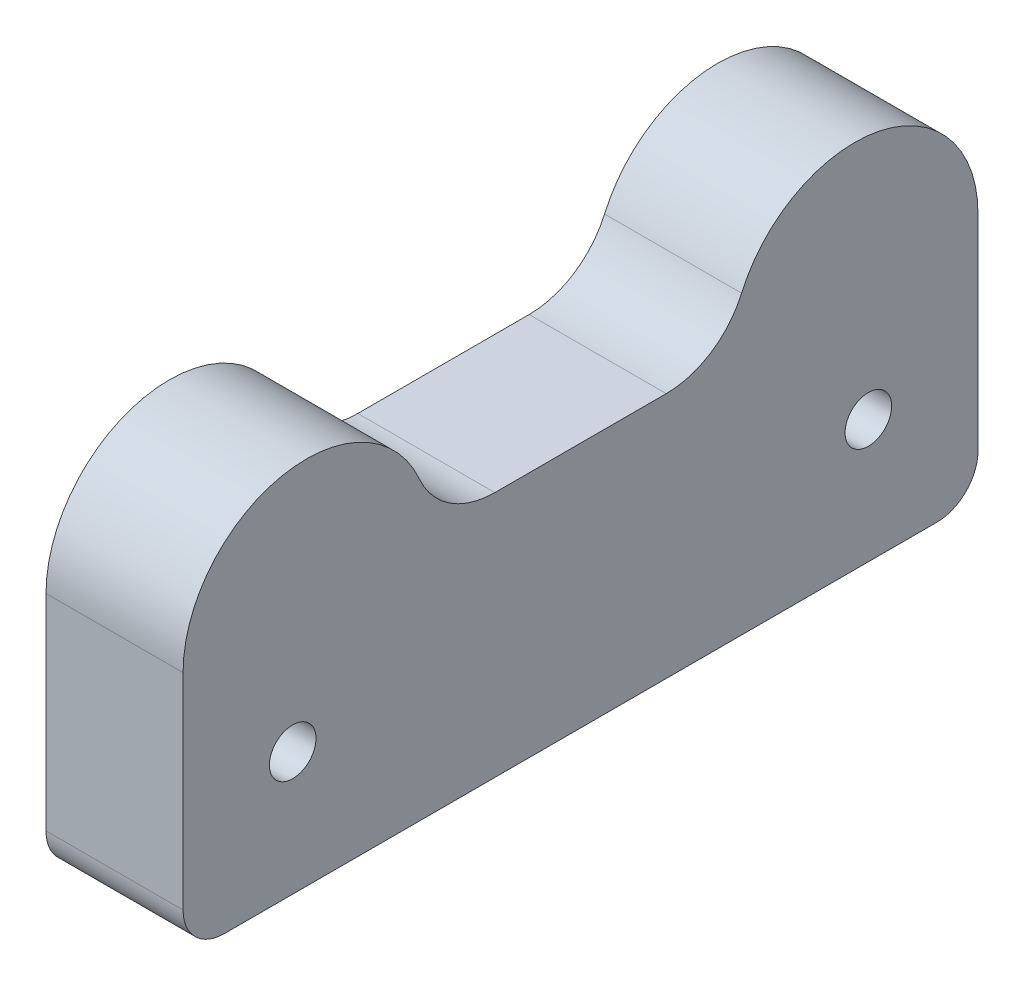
ISO-10303-21;
HEADER;
FILE_DESCRIPTION(('STEP AP214'),'2;1');
FILE_NAME('part.step','',(''),(''),'','','');
FILE_SCHEMA(('AUTOMOTIVE_DESIGN { 1 0 10303 214 1 1 1 1 }'));
ENDSEC;
DATA;
#1=APPLICATION_CONTEXT('core data for automotive mechanical design processes');
#2=APPLICATION_PROTOCOL_DEFINITION('international standard','automotive_design',2000,#1);
#3=PRODUCT_CONTEXT('',#1,'mechanical');
#4=PRODUCT('Part','Part','',(#3));
#5=PRODUCT_RELATED_PRODUCT_CATEGORY('part','',(#4));
#6=PRODUCT_DEFINITION_FORMATION('','',#4);
#7=PRODUCT_DEFINITION_CONTEXT('part definition',#1,'design');
#8=PRODUCT_DEFINITION('design','',#6,#7);
#9=PRODUCT_DEFINITION_SHAPE('','',#8);
#10=(LENGTH_UNIT() NAMED_UNIT(*) SI_UNIT(.MILLI.,.METRE.));
#11=(NAMED_UNIT(*) PLANE_ANGLE_UNIT() SI_UNIT($,.RADIAN.));
#12=(NAMED_UNIT(*) SI_UNIT($,.STERADIAN.) SOLID_ANGLE_UNIT());
#13=UNCERTAINTY_MEASURE_WITH_UNIT(LENGTH_MEASURE(1.E-05),#10,'distance_accuracy_value','');
#14=(GEOMETRIC_REPRESENTATION_CONTEXT(3) GLOBAL_UNCERTAINTY_ASSIGNED_CONTEXT((#13)) GLOBAL_UNIT_ASSIGNED_CONTEXT((#10,
#11,#12)) REPRESENTATION_CONTEXT('',''));
#15=CARTESIAN_POINT('',(0.,0.,0.));
#16=DIRECTION('',(0.,0.,1.));
#17=DIRECTION('',(1.,0.,0.));
#18=AXIS2_PLACEMENT_3D('',#15,#16,#17);
#19=CARTESIAN_POINT('',(10.,0.,0.));
#20=DIRECTION('',(0.,0.,-1.));
#21=DIRECTION('',(-1.,0.,0.));
#22=AXIS2_PLACEMENT_3D('',#19,#20,#21);
#23=PLANE('',#22);
#24=DIRECTION('',(0.,-1.,0.));
#25=VECTOR('',#24,1.);
#26=CARTESIAN_POINT('',(0.,0.,0.));
#27=LINE('',#26,#25);
#28=CARTESIAN_POINT('',(0.,18.,0.));
#29=VERTEX_POINT('',#28);
#30=CARTESIAN_POINT('',(0.,3.,0.));
#31=VERTEX_POINT('',#30);
#32=EDGE_CURVE('E161',#29,#31,#27,.T.);
#33=ORIENTED_EDGE('',*,*,#32,.T.);
#34=DIRECTION('',(-1.,0.,0.));
#35=VECTOR('',#34,1.);
#36=CARTESIAN_POINT('',(10.,3.,0.));
#37=LINE('',#36,#35);
#38=CARTESIAN_POINT('',(10.,3.,0.));
#39=VERTEX_POINT('',#38);
#40=EDGE_CURVE('E183',#31,#39,#37,.F.);
#41=ORIENTED_EDGE('',*,*,#40,.T.);
#42=DIRECTION('',(0.,-1.,0.));
#43=VECTOR('',#42,1.);
#44=CARTESIAN_POINT('',(10.,0.,0.));
#45=LINE('',#44,#43);
#46=CARTESIAN_POINT('',(10.,18.,0.));
#47=VERTEX_POINT('',#46);
#48=EDGE_CURVE('E151',#47,#39,#45,.T.);
#49=ORIENTED_EDGE('',*,*,#48,.F.);
#50=DIRECTION('',(-1.,0.,0.));
#51=VECTOR('',#50,1.);
#52=CARTESIAN_POINT('',(10.,18.,0.));
#53=LINE('',#52,#51);
#54=EDGE_CURVE('E140',#47,#29,#53,.T.);
#55=ORIENTED_EDGE('',*,*,#54,.T.);
#56=EDGE_LOOP('',(#33,#41,#49,#55));
#57=FACE_BOUND('',#56,.T.);
#58=ADVANCED_FACE('F41',(#57),#23,.F.);
#59=CARTESIAN_POINT('',(10.,0.,0.));
#60=DIRECTION('',(0.,1.,0.));
#61=DIRECTION('',(0.,0.,1.));
#62=AXIS2_PLACEMENT_3D('',#59,#60,#61);
#63=PLANE('',#62);
#64=DIRECTION('',(0.,0.,-1.));
#65=VECTOR('',#64,1.);
#66=CARTESIAN_POINT('',(0.,0.,0.));
#67=LINE('',#66,#65);
#68=CARTESIAN_POINT('',(0.,0.,-3.));
#69=VERTEX_POINT('',#68);
#70=CARTESIAN_POINT('',(0.,0.,-55.));
#71=VERTEX_POINT('',#70);
#72=EDGE_CURVE('E130',#69,#71,#67,.T.);
#73=ORIENTED_EDGE('',*,*,#72,.T.);
#74=DIRECTION('',(-1.,0.,0.));
#75=VECTOR('',#74,1.);
#76=CARTESIAN_POINT('',(10.,0.,-55.));
#77=LINE('',#76,#75);
#78=CARTESIAN_POINT('',(10.,0.,-55.));
#79=VERTEX_POINT('',#78);
#80=EDGE_CURVE('E179',#71,#79,#77,.F.);
#81=ORIENTED_EDGE('',*,*,#80,.T.);
#82=DIRECTION('',(0.,0.,-1.));
#83=VECTOR('',#82,1.);
#84=CARTESIAN_POINT('',(10.,0.,0.));
#85=LINE('',#84,#83);
#86=CARTESIAN_POINT('',(10.,0.,-3.));
#87=VERTEX_POINT('',#86);
#88=EDGE_CURVE('E152',#87,#79,#85,.T.);
#89=ORIENTED_EDGE('',*,*,#88,.F.);
#90=DIRECTION('',(-1.,0.,0.));
#91=VECTOR('',#90,1.);
#92=CARTESIAN_POINT('',(10.,0.,-3.));
#93=LINE('',#92,#91);
#94=EDGE_CURVE('E177',#87,#69,#93,.T.);
#95=ORIENTED_EDGE('',*,*,#94,.T.);
#96=EDGE_LOOP('',(#73,#81,#89,#95));
#97=FACE_BOUND('',#96,.T.);
#98=ADVANCED_FACE('F218',(#97),#63,.F.);
#99=CARTESIAN_POINT('',(10.,0.,-58.));
#100=DIRECTION('',(0.,0.,1.));
#101=DIRECTION('',(1.,0.,0.));
#102=AXIS2_PLACEMENT_3D('',#99,#100,#101);
#103=PLANE('',#102);
#104=DIRECTION('',(0.,1.,0.));
#105=VECTOR('',#104,1.);
#106=CARTESIAN_POINT('',(10.,0.,-58.));
#107=LINE('',#106,#105);
#108=CARTESIAN_POINT('',(10.,3.,-58.));
#109=VERTEX_POINT('',#108);
#110=CARTESIAN_POINT('',(10.,18.,-58.));
#111=VERTEX_POINT('',#110);
#112=EDGE_CURVE('E160',#109,#111,#107,.T.);
#113=ORIENTED_EDGE('',*,*,#112,.F.);
#114=DIRECTION('',(-1.,0.,0.));
#115=VECTOR('',#114,1.);
#116=CARTESIAN_POINT('',(10.,3.,-58.));
#117=LINE('',#116,#115);
#118=CARTESIAN_POINT('',(0.,3.,-58.));
#119=VERTEX_POINT('',#118);
#120=EDGE_CURVE('E123',#109,#119,#117,.T.);
#121=ORIENTED_EDGE('',*,*,#120,.T.);
#122=DIRECTION('',(0.,1.,0.));
#123=VECTOR('',#122,1.);
#124=CARTESIAN_POINT('',(0.,0.,-58.));
#125=LINE('',#124,#123);
#126=CARTESIAN_POINT('',(0.,18.,-58.));
#127=VERTEX_POINT('',#126);
#128=EDGE_CURVE('E119',#119,#127,#125,.T.);
#129=ORIENTED_EDGE('',*,*,#128,.T.);
#130=DIRECTION('',(-1.,0.,0.));
#131=VECTOR('',#130,1.);
#132=CARTESIAN_POINT('',(10.,18.,-58.));
#133=LINE('',#132,#131);
#134=EDGE_CURVE('E122',#111,#127,#133,.T.);
#135=ORIENTED_EDGE('',*,*,#134,.F.);
#136=EDGE_LOOP('',(#113,#121,#129,#135));
#137=FACE_BOUND('',#136,.T.);
#138=ADVANCED_FACE('F116',(#137),#103,.F.);
#139=CARTESIAN_POINT('',(10.,18.,0.));
#140=DIRECTION('',(0.,-1.,0.));
#141=DIRECTION('',(0.,0.,-1.));
#142=AXIS2_PLACEMENT_3D('',#139,#140,#141);
#143=PLANE('',#142);
#144=DIRECTION('',(0.,0.,1.));
#145=VECTOR('',#144,1.);
#146=CARTESIAN_POINT('',(10.,18.,0.));
#147=LINE('',#146,#145);
#148=CARTESIAN_POINT('',(10.,18.,-35.2522729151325));
#149=VERTEX_POINT('',#148);
#150=CARTESIAN_POINT('',(10.,18.,-22.7477270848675));
#151=VERTEX_POINT('',#150);
#152=EDGE_CURVE('E157',#149,#151,#147,.T.);
#153=ORIENTED_EDGE('',*,*,#152,.F.);
#154=DIRECTION('',(1.,0.,0.));
#155=VECTOR('',#154,1.);
#156=CARTESIAN_POINT('',(10.,18.,-35.2522729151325));
#157=LINE('',#156,#155);
#158=CARTESIAN_POINT('',(0.,18.,-35.2522729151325));
#159=VERTEX_POINT('',#158);
#160=EDGE_CURVE('E186',#149,#159,#157,.F.);
#161=ORIENTED_EDGE('',*,*,#160,.T.);
#162=DIRECTION('',(0.,0.,1.));
#163=VECTOR('',#162,1.);
#164=CARTESIAN_POINT('',(0.,18.,0.));
#165=LINE('',#164,#163);
#166=CARTESIAN_POINT('',(0.,18.,-22.7477270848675));
#167=VERTEX_POINT('',#166);
#168=EDGE_CURVE('E127',#159,#167,#165,.T.);
#169=ORIENTED_EDGE('',*,*,#168,.T.);
#170=DIRECTION('',(1.,0.,0.));
#171=VECTOR('',#170,1.);
#172=CARTESIAN_POINT('',(10.,18.,-22.7477270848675));
#173=LINE('',#172,#171);
#174=EDGE_CURVE('E189',#167,#151,#173,.T.);
#175=ORIENTED_EDGE('',*,*,#174,.T.);
#176=EDGE_LOOP('',(#153,#161,#169,#175));
#177=FACE_BOUND('',#176,.T.);
#178=ADVANCED_FACE('F204',(#177),#143,.F.);
#179=CARTESIAN_POINT('',(10.,0.,0.));
#180=DIRECTION('',(-1.,0.,0.));
#181=DIRECTION('',(0.,0.,1.));
#182=AXIS2_PLACEMENT_3D('',#179,#180,#181);
#183=PLANE('',#182);
#184=CARTESIAN_POINT('',(10.,9.,-8.));
#185=DIRECTION('',(1.,0.,0.));
#186=DIRECTION('',(0.,0.,-1.));
#187=AXIS2_PLACEMENT_3D('',#184,#185,#186);
#188=CIRCLE('',#187,1.7);
#189=CARTESIAN_POINT('',(10.,9.,-9.7));
#190=VERTEX_POINT('',#189);
#191=EDGE_CURVE('E150',#190,#190,#188,.T.);
#192=ORIENTED_EDGE('',*,*,#191,.F.);
#193=EDGE_LOOP('',(#192));
#194=FACE_BOUND('',#193,.T.);
#195=CARTESIAN_POINT('',(10.,9.,-50.));
#196=DIRECTION('',(1.,0.,0.));
#197=DIRECTION('',(0.,0.,-1.));
#198=AXIS2_PLACEMENT_3D('',#195,#196,#197);
#199=CIRCLE('',#198,1.7);
#200=CARTESIAN_POINT('',(10.,9.,-51.7));
#201=VERTEX_POINT('',#200);
#202=EDGE_CURVE('E258',#201,#201,#199,.T.);
#203=ORIENTED_EDGE('',*,*,#202,.F.);
#204=EDGE_LOOP('',(#203));
#205=FACE_BOUND('',#204,.T.);
#206=ORIENTED_EDGE('',*,*,#88,.T.);
#207=CARTESIAN_POINT('',(10.,3.,-55.));
#208=DIRECTION('',(-1.,0.,0.));
#209=DIRECTION('',(0.,0.,1.));
#210=AXIS2_PLACEMENT_3D('',#207,#208,#209);
#211=CIRCLE('',#210,3.);
#212=EDGE_CURVE('E181',#79,#109,#211,.F.);
#213=ORIENTED_EDGE('',*,*,#212,.T.);
#214=ORIENTED_EDGE('',*,*,#112,.T.);
#215=CARTESIAN_POINT('',(10.,18.,-49.));
#216=DIRECTION('',(1.,0.,0.));
#217=DIRECTION('',(0.,0.,-1.));
#218=AXIS2_PLACEMENT_3D('',#215,#216,#217);
#219=CIRCLE('',#218,9.);
#220=CARTESIAN_POINT('',(10.,21.6,-40.7513637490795));
#221=VERTEX_POINT('',#220);
#222=EDGE_CURVE('E137',#111,#221,#219,.T.);
#223=ORIENTED_EDGE('',*,*,#222,.T.);
#224=CARTESIAN_POINT('',(10.,24.,-35.2522729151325));
#225=DIRECTION('',(-1.,0.,0.));
#226=DIRECTION('',(0.,0.,1.));
#227=AXIS2_PLACEMENT_3D('',#224,#225,#226);
#228=CIRCLE('',#227,6.);
#229=EDGE_CURVE('E197',#221,#149,#228,.T.);
#230=ORIENTED_EDGE('',*,*,#229,.T.);
#231=ORIENTED_EDGE('',*,*,#152,.T.);
#232=CARTESIAN_POINT('',(10.,24.,-22.7477270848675));
#233=DIRECTION('',(-1.,0.,0.));
#234=DIRECTION('',(0.,0.,1.));
#235=AXIS2_PLACEMENT_3D('',#232,#233,#234);
#236=CIRCLE('',#235,6.);
#237=CARTESIAN_POINT('',(10.,21.6,-17.2486362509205));
#238=VERTEX_POINT('',#237);
#239=EDGE_CURVE('E47',#151,#238,#236,.T.);
#240=ORIENTED_EDGE('',*,*,#239,.T.);
#241=CARTESIAN_POINT('',(10.,18.,-9.));
#242=DIRECTION('',(1.,0.,0.));
#243=DIRECTION('',(0.,0.,-1.));
#244=AXIS2_PLACEMENT_3D('',#241,#242,#243);
#245=CIRCLE('',#244,9.);
#246=EDGE_CURVE('E145',#238,#47,#245,.T.);
#247=ORIENTED_EDGE('',*,*,#246,.T.);
#248=ORIENTED_EDGE('',*,*,#48,.T.);
#249=CARTESIAN_POINT('',(10.,3.,-3.));
#250=DIRECTION('',(-1.,0.,0.));
#251=DIRECTION('',(0.,0.,1.));
#252=AXIS2_PLACEMENT_3D('',#249,#250,#251);
#253=CIRCLE('',#252,3.);
#254=EDGE_CURVE('E182',#39,#87,#253,.F.);
#255=ORIENTED_EDGE('',*,*,#254,.T.);
#256=EDGE_LOOP('',(#206,#213,#214,#223,#230,#231,#240,#247,#248,#255));
#257=FACE_BOUND('',#256,.T.);
#258=ADVANCED_FACE('F199',(#194,#205,#257),#183,.F.);
#259=CARTESIAN_POINT('',(0.,0.,0.));
#260=DIRECTION('',(-1.,0.,0.));
#261=DIRECTION('',(0.,0.,1.));
#262=AXIS2_PLACEMENT_3D('',#259,#260,#261);
#263=PLANE('',#262);
#264=CARTESIAN_POINT('',(0.,9.,-8.));
#265=DIRECTION('',(1.,0.,0.));
#266=DIRECTION('',(0.,0.,-1.));
#267=AXIS2_PLACEMENT_3D('',#264,#265,#266);
#268=CIRCLE('',#267,1.7);
#269=CARTESIAN_POINT('',(0.,9.,-9.7));
#270=VERTEX_POINT('',#269);
#271=EDGE_CURVE('E142',#270,#270,#268,.T.);
#272=ORIENTED_EDGE('',*,*,#271,.T.);
#273=EDGE_LOOP('',(#272));
#274=FACE_BOUND('',#273,.T.);
#275=CARTESIAN_POINT('',(0.,9.,-50.));
#276=DIRECTION('',(1.,0.,0.));
#277=DIRECTION('',(0.,0.,-1.));
#278=AXIS2_PLACEMENT_3D('',#275,#276,#277);
#279=CIRCLE('',#278,1.7);
#280=CARTESIAN_POINT('',(0.,9.,-51.7));
#281=VERTEX_POINT('',#280);
#282=EDGE_CURVE('E251',#281,#281,#279,.T.);
#283=ORIENTED_EDGE('',*,*,#282,.T.);
#284=EDGE_LOOP('',(#283));
#285=FACE_BOUND('',#284,.T.);
#286=ORIENTED_EDGE('',*,*,#128,.F.);
#287=CARTESIAN_POINT('',(0.,3.,-55.));
#288=DIRECTION('',(-1.,0.,0.));
#289=DIRECTION('',(0.,0.,1.));
#290=AXIS2_PLACEMENT_3D('',#287,#288,#289);
#291=CIRCLE('',#290,3.);
#292=EDGE_CURVE('E175',#119,#71,#291,.T.);
#293=ORIENTED_EDGE('',*,*,#292,.T.);
#294=ORIENTED_EDGE('',*,*,#72,.F.);
#295=CARTESIAN_POINT('',(0.,3.,-3.));
#296=DIRECTION('',(-1.,0.,0.));
#297=DIRECTION('',(0.,0.,1.));
#298=AXIS2_PLACEMENT_3D('',#295,#296,#297);
#299=CIRCLE('',#298,3.);
#300=EDGE_CURVE('E174',#69,#31,#299,.T.);
#301=ORIENTED_EDGE('',*,*,#300,.T.);
#302=ORIENTED_EDGE('',*,*,#32,.F.);
#303=CARTESIAN_POINT('',(0.,18.,-9.));
#304=DIRECTION('',(1.,0.,0.));
#305=DIRECTION('',(0.,0.,-1.));
#306=AXIS2_PLACEMENT_3D('',#303,#304,#305);
#307=CIRCLE('',#306,9.);
#308=CARTESIAN_POINT('',(0.,21.6,-17.2486362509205));
#309=VERTEX_POINT('',#308);
#310=EDGE_CURVE('E163',#309,#29,#307,.T.);
#311=ORIENTED_EDGE('',*,*,#310,.F.);
#312=CARTESIAN_POINT('',(0.,24.,-22.7477270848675));
#313=DIRECTION('',(-1.,0.,0.));
#314=DIRECTION('',(0.,0.,1.));
#315=AXIS2_PLACEMENT_3D('',#312,#313,#314);
#316=CIRCLE('',#315,6.);
#317=EDGE_CURVE('E11',#309,#167,#316,.F.);
#318=ORIENTED_EDGE('',*,*,#317,.T.);
#319=ORIENTED_EDGE('',*,*,#168,.F.);
#320=CARTESIAN_POINT('',(0.,24.,-35.2522729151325));
#321=DIRECTION('',(-1.,0.,0.));
#322=DIRECTION('',(0.,0.,1.));
#323=AXIS2_PLACEMENT_3D('',#320,#321,#322);
#324=CIRCLE('',#323,6.);
#325=CARTESIAN_POINT('',(0.,21.6,-40.7513637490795));
#326=VERTEX_POINT('',#325);
#327=EDGE_CURVE('E143',#159,#326,#324,.F.);
#328=ORIENTED_EDGE('',*,*,#327,.T.);
#329=CARTESIAN_POINT('',(0.,18.,-49.));
#330=DIRECTION('',(1.,0.,0.));
#331=DIRECTION('',(0.,0.,-1.));
#332=AXIS2_PLACEMENT_3D('',#329,#330,#331);
#333=CIRCLE('',#332,9.);
#334=EDGE_CURVE('E132',#127,#326,#333,.T.);
#335=ORIENTED_EDGE('',*,*,#334,.F.);
#336=EDGE_LOOP('',(#286,#293,#294,#301,#302,#311,#318,#319,#328,#335));
#337=FACE_BOUND('',#336,.T.);
#338=ADVANCED_FACE('F139',(#274,#285,#337),#263,.T.);
#339=CARTESIAN_POINT('',(0.,18.,-49.));
#340=DIRECTION('',(1.,0.,0.));
#341=DIRECTION('',(0.,0.,-1.));
#342=AXIS2_PLACEMENT_3D('',#339,#340,#341);
#343=CYLINDRICAL_SURFACE('',#342,9.);
#344=ORIENTED_EDGE('',*,*,#334,.T.);
#345=DIRECTION('',(1.,0.,0.));
#346=VECTOR('',#345,1.);
#347=CARTESIAN_POINT('',(0.,21.6,-40.7513637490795));
#348=LINE('',#347,#346);
#349=EDGE_CURVE('E193',#326,#221,#348,.T.);
#350=ORIENTED_EDGE('',*,*,#349,.T.);
#351=ORIENTED_EDGE('',*,*,#222,.F.);
#352=ORIENTED_EDGE('',*,*,#134,.T.);
#353=EDGE_LOOP('',(#344,#350,#351,#352));
#354=FACE_BOUND('',#353,.T.);
#355=ADVANCED_FACE('F134',(#354),#343,.T.);
#356=CARTESIAN_POINT('',(0.,18.,-9.));
#357=DIRECTION('',(1.,0.,0.));
#358=DIRECTION('',(0.,0.,-1.));
#359=AXIS2_PLACEMENT_3D('',#356,#357,#358);
#360=CYLINDRICAL_SURFACE('',#359,9.);
#361=ORIENTED_EDGE('',*,*,#246,.F.);
#362=DIRECTION('',(1.,0.,0.));
#363=VECTOR('',#362,1.);
#364=CARTESIAN_POINT('',(0.,21.6,-17.2486362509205));
#365=LINE('',#364,#363);
#366=EDGE_CURVE('E64',#238,#309,#365,.F.);
#367=ORIENTED_EDGE('',*,*,#366,.T.);
#368=ORIENTED_EDGE('',*,*,#310,.T.);
#369=ORIENTED_EDGE('',*,*,#54,.F.);
#370=EDGE_LOOP('',(#361,#367,#368,#369));
#371=FACE_BOUND('',#370,.T.);
#372=ADVANCED_FACE('F249',(#371),#360,.T.);
#373=CARTESIAN_POINT('',(0.,9.,-50.));
#374=DIRECTION('',(1.,0.,0.));
#375=DIRECTION('',(0.,0.,-1.));
#376=AXIS2_PLACEMENT_3D('',#373,#374,#375);
#377=CYLINDRICAL_SURFACE('',#376,1.7);
#378=ORIENTED_EDGE('',*,*,#282,.F.);
#379=EDGE_LOOP('',(#378));
#380=FACE_BOUND('',#379,.T.);
#381=ORIENTED_EDGE('',*,*,#202,.T.);
#382=EDGE_LOOP('',(#381));
#383=FACE_BOUND('',#382,.T.);
#384=ADVANCED_FACE('F237',(#380,#383),#377,.F.);
#385=CARTESIAN_POINT('',(0.,9.,-8.));
#386=DIRECTION('',(1.,0.,0.));
#387=DIRECTION('',(0.,0.,-1.));
#388=AXIS2_PLACEMENT_3D('',#385,#386,#387);
#389=CYLINDRICAL_SURFACE('',#388,1.7);
#390=ORIENTED_EDGE('',*,*,#271,.F.);
#391=EDGE_LOOP('',(#390));
#392=FACE_BOUND('',#391,.T.);
#393=ORIENTED_EDGE('',*,*,#191,.T.);
#394=EDGE_LOOP('',(#393));
#395=FACE_BOUND('',#394,.T.);
#396=ADVANCED_FACE('F232',(#392,#395),#389,.F.);
#397=CARTESIAN_POINT('',(10.,3.,-55.));
#398=DIRECTION('',(-1.,0.,0.));
#399=DIRECTION('',(0.,0.,1.));
#400=AXIS2_PLACEMENT_3D('',#397,#398,#399);
#401=CYLINDRICAL_SURFACE('',#400,3.);
#402=ORIENTED_EDGE('',*,*,#212,.F.);
#403=ORIENTED_EDGE('',*,*,#80,.F.);
#404=ORIENTED_EDGE('',*,*,#292,.F.);
#405=ORIENTED_EDGE('',*,*,#120,.F.);
#406=EDGE_LOOP('',(#402,#403,#404,#405));
#407=FACE_BOUND('',#406,.T.);
#408=ADVANCED_FACE('F214',(#407),#401,.T.);
#409=CARTESIAN_POINT('',(10.,3.,-3.));
#410=DIRECTION('',(-1.,0.,0.));
#411=DIRECTION('',(0.,0.,1.));
#412=AXIS2_PLACEMENT_3D('',#409,#410,#411);
#413=CYLINDRICAL_SURFACE('',#412,3.);
#414=ORIENTED_EDGE('',*,*,#254,.F.);
#415=ORIENTED_EDGE('',*,*,#40,.F.);
#416=ORIENTED_EDGE('',*,*,#300,.F.);
#417=ORIENTED_EDGE('',*,*,#94,.F.);
#418=EDGE_LOOP('',(#414,#415,#416,#417));
#419=FACE_BOUND('',#418,.T.);
#420=ADVANCED_FACE('F208',(#419),#413,.T.);
#421=CARTESIAN_POINT('',(0.,24.,-35.2522729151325));
#422=DIRECTION('',(1.,0.,0.));
#423=DIRECTION('',(0.,0.,-1.));
#424=AXIS2_PLACEMENT_3D('',#421,#422,#423);
#425=CYLINDRICAL_SURFACE('',#424,6.);
#426=ORIENTED_EDGE('',*,*,#229,.F.);
#427=ORIENTED_EDGE('',*,*,#349,.F.);
#428=ORIENTED_EDGE('',*,*,#327,.F.);
#429=ORIENTED_EDGE('',*,*,#160,.F.);
#430=EDGE_LOOP('',(#426,#427,#428,#429));
#431=FACE_BOUND('',#430,.T.);
#432=ADVANCED_FACE('F206',(#431),#425,.F.);
#433=CARTESIAN_POINT('',(0.,24.,-22.7477270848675));
#434=DIRECTION('',(1.,0.,0.));
#435=DIRECTION('',(0.,0.,-1.));
#436=AXIS2_PLACEMENT_3D('',#433,#434,#435);
#437=CYLINDRICAL_SURFACE('',#436,6.);
#438=ORIENTED_EDGE('',*,*,#317,.F.);
#439=ORIENTED_EDGE('',*,*,#366,.F.);
#440=ORIENTED_EDGE('',*,*,#239,.F.);
#441=ORIENTED_EDGE('',*,*,#174,.F.);
#442=EDGE_LOOP('',(#438,#439,#440,#441));
#443=FACE_BOUND('',#442,.T.);
#444=ADVANCED_FACE('F43',(#443),#437,.F.);
#445=CLOSED_SHELL('',(#58,#98,#138,#178,#258,#338,#355,#372,#384,#396,#408,#420,#432,#444));
#446=MANIFOLD_SOLID_BREP('B2',#445);
#447=ADVANCED_BREP_SHAPE_REPRESENTATION('',(#18,#446),#14);
#448=SHAPE_DEFINITION_REPRESENTATION(#9,#447);
ENDSEC;
END-ISO-10303-21;
